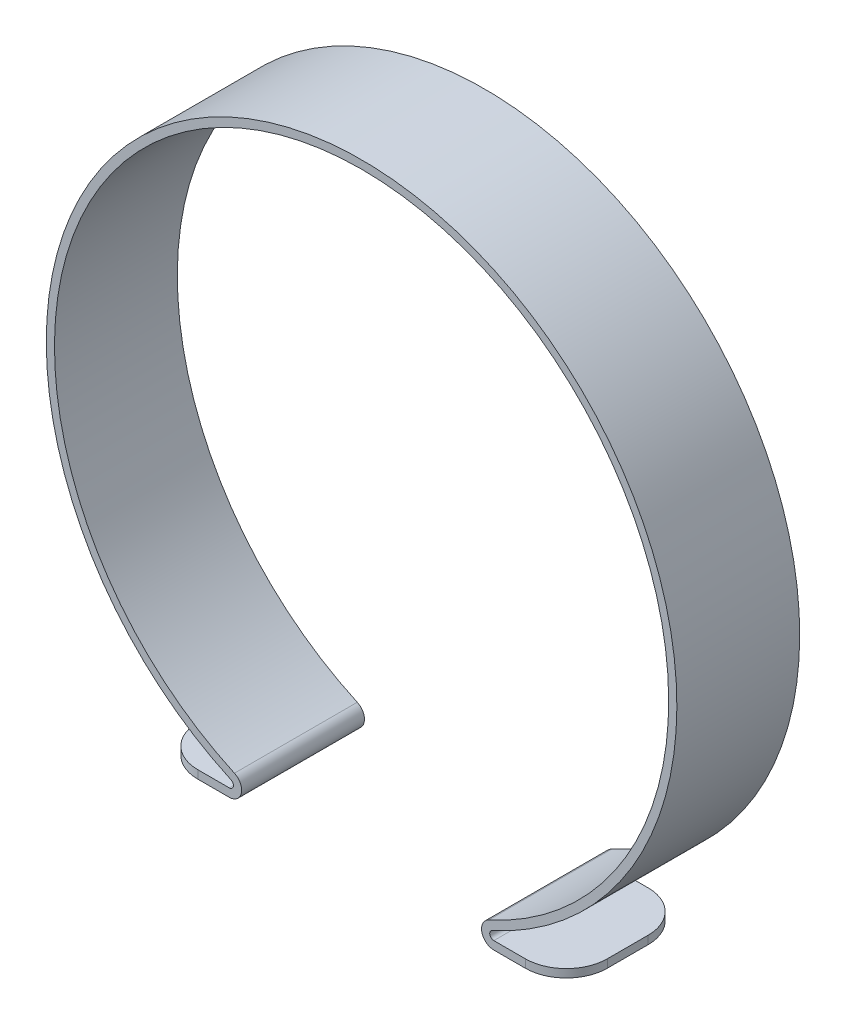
ISO-10303-21;
HEADER;
FILE_DESCRIPTION(('STEP AP214'),'2;1');
FILE_NAME('part.step','',(''),(''),'','','');
FILE_SCHEMA(('AUTOMOTIVE_DESIGN { 1 0 10303 214 1 1 1 1 }'));
ENDSEC;
DATA;
#1=APPLICATION_CONTEXT('core data for automotive mechanical design processes');
#2=APPLICATION_PROTOCOL_DEFINITION('international standard','automotive_design',2000,#1);
#3=PRODUCT_CONTEXT('',#1,'mechanical');
#4=PRODUCT('Part','Part','',(#3));
#5=PRODUCT_RELATED_PRODUCT_CATEGORY('part','',(#4));
#6=PRODUCT_DEFINITION_FORMATION('','',#4);
#7=PRODUCT_DEFINITION_CONTEXT('part definition',#1,'design');
#8=PRODUCT_DEFINITION('design','',#6,#7);
#9=PRODUCT_DEFINITION_SHAPE('','',#8);
#10=(LENGTH_UNIT() NAMED_UNIT(*) SI_UNIT(.MILLI.,.METRE.));
#11=(NAMED_UNIT(*) PLANE_ANGLE_UNIT() SI_UNIT($,.RADIAN.));
#12=(NAMED_UNIT(*) SI_UNIT($,.STERADIAN.) SOLID_ANGLE_UNIT());
#13=UNCERTAINTY_MEASURE_WITH_UNIT(LENGTH_MEASURE(1.E-05),#10,'distance_accuracy_value','');
#14=(GEOMETRIC_REPRESENTATION_CONTEXT(3) GLOBAL_UNCERTAINTY_ASSIGNED_CONTEXT((#13)) GLOBAL_UNIT_ASSIGNED_CONTEXT((#10,
#11,#12)) REPRESENTATION_CONTEXT('',''));
#15=CARTESIAN_POINT('',(0.,0.,0.));
#16=DIRECTION('',(0.,0.,1.));
#17=DIRECTION('',(1.,0.,0.));
#18=AXIS2_PLACEMENT_3D('',#15,#16,#17);
#19=CARTESIAN_POINT('',(20.,1.,10.));
#20=DIRECTION('',(0.,-1.,0.));
#21=DIRECTION('',(0.,0.,-1.));
#22=AXIS2_PLACEMENT_3D('',#19,#20,#21);
#23=CYLINDRICAL_SURFACE('',#22,5.);
#24=CARTESIAN_POINT('',(20.,0.,10.));
#25=DIRECTION('',(0.,-1.,0.));
#26=DIRECTION('',(0.,0.,-1.));
#27=AXIS2_PLACEMENT_3D('',#24,#25,#26);
#28=CIRCLE('',#27,5.);
#29=CARTESIAN_POINT('',(25.,0.,10.));
#30=VERTEX_POINT('',#29);
#31=CARTESIAN_POINT('',(20.,0.,15.));
#32=VERTEX_POINT('',#31);
#33=EDGE_CURVE('E136',#30,#32,#28,.T.);
#34=ORIENTED_EDGE('',*,*,#33,.F.);
#35=DIRECTION('',(0.,1.,0.));
#36=VECTOR('',#35,1.);
#37=CARTESIAN_POINT('',(25.,1.,10.));
#38=LINE('',#37,#36);
#39=CARTESIAN_POINT('',(25.,1.,10.));
#40=VERTEX_POINT('',#39);
#41=EDGE_CURVE('E128',#40,#30,#38,.F.);
#42=ORIENTED_EDGE('',*,*,#41,.F.);
#43=CARTESIAN_POINT('',(20.,1.,10.));
#44=DIRECTION('',(0.,-1.,0.));
#45=DIRECTION('',(0.,0.,-1.));
#46=AXIS2_PLACEMENT_3D('',#43,#44,#45);
#47=CIRCLE('',#46,5.);
#48=CARTESIAN_POINT('',(20.,1.,15.));
#49=VERTEX_POINT('',#48);
#50=EDGE_CURVE('E204',#40,#49,#47,.T.);
#51=ORIENTED_EDGE('',*,*,#50,.T.);
#52=DIRECTION('',(0.,1.,0.));
#53=VECTOR('',#52,1.);
#54=CARTESIAN_POINT('',(20.,1.5,15.));
#55=LINE('',#54,#53);
#56=EDGE_CURVE('E147',#32,#49,#55,.T.);
#57=ORIENTED_EDGE('',*,*,#56,.F.);
#58=EDGE_LOOP('',(#34,#42,#51,#57));
#59=FACE_BOUND('',#58,.T.);
#60=ADVANCED_FACE('F17',(#59),#23,.T.);
#61=CARTESIAN_POINT('',(20.,1.9551282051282,5.));
#62=DIRECTION('',(0.,-1.,0.));
#63=DIRECTION('',(0.,0.,-1.));
#64=AXIS2_PLACEMENT_3D('',#61,#62,#63);
#65=CYLINDRICAL_SURFACE('',#64,5.);
#66=CARTESIAN_POINT('',(20.,0.,5.));
#67=DIRECTION('',(0.,-1.,0.));
#68=DIRECTION('',(0.,0.,-1.));
#69=AXIS2_PLACEMENT_3D('',#66,#67,#68);
#70=CIRCLE('',#69,5.);
#71=CARTESIAN_POINT('',(20.,0.,0.));
#72=VERTEX_POINT('',#71);
#73=CARTESIAN_POINT('',(25.,0.,5.));
#74=VERTEX_POINT('',#73);
#75=EDGE_CURVE('E20',#72,#74,#70,.T.);
#76=ORIENTED_EDGE('',*,*,#75,.F.);
#77=DIRECTION('',(0.,-1.,0.));
#78=VECTOR('',#77,1.);
#79=CARTESIAN_POINT('',(20.,1.9551282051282,0.));
#80=LINE('',#79,#78);
#81=CARTESIAN_POINT('',(20.,1.,0.));
#82=VERTEX_POINT('',#81);
#83=EDGE_CURVE('E113',#72,#82,#80,.F.);
#84=ORIENTED_EDGE('',*,*,#83,.T.);
#85=CARTESIAN_POINT('',(20.,1.,5.));
#86=DIRECTION('',(0.,-1.,0.));
#87=DIRECTION('',(0.,0.,-1.));
#88=AXIS2_PLACEMENT_3D('',#85,#86,#87);
#89=CIRCLE('',#88,5.);
#90=CARTESIAN_POINT('',(25.,1.,5.));
#91=VERTEX_POINT('',#90);
#92=EDGE_CURVE('E124',#82,#91,#89,.T.);
#93=ORIENTED_EDGE('',*,*,#92,.T.);
#94=DIRECTION('',(0.,1.,0.));
#95=VECTOR('',#94,1.);
#96=CARTESIAN_POINT('',(25.,1.,5.));
#97=LINE('',#96,#95);
#98=EDGE_CURVE('E118',#74,#91,#97,.T.);
#99=ORIENTED_EDGE('',*,*,#98,.F.);
#100=EDGE_LOOP('',(#76,#84,#93,#99));
#101=FACE_BOUND('',#100,.T.);
#102=ADVANCED_FACE('F120',(#101),#65,.T.);
#103=CARTESIAN_POINT('',(25.,1.,15.));
#104=DIRECTION('',(1.,0.,0.));
#105=DIRECTION('',(0.,0.,-1.));
#106=AXIS2_PLACEMENT_3D('',#103,#104,#105);
#107=PLANE('',#106);
#108=DIRECTION('',(0.,0.,1.));
#109=VECTOR('',#108,1.);
#110=CARTESIAN_POINT('',(25.,1.,15.));
#111=LINE('',#110,#109);
#112=EDGE_CURVE('E202',#91,#40,#111,.T.);
#113=ORIENTED_EDGE('',*,*,#112,.T.);
#114=ORIENTED_EDGE('',*,*,#41,.T.);
#115=DIRECTION('',(0.,0.,1.));
#116=VECTOR('',#115,1.);
#117=CARTESIAN_POINT('',(25.,0.,15.));
#118=LINE('',#117,#116);
#119=EDGE_CURVE('E131',#74,#30,#118,.T.);
#120=ORIENTED_EDGE('',*,*,#119,.F.);
#121=ORIENTED_EDGE('',*,*,#98,.T.);
#122=EDGE_LOOP('',(#113,#114,#120,#121));
#123=FACE_BOUND('',#122,.T.);
#124=ADVANCED_FACE('F132',(#123),#107,.T.);
#125=CARTESIAN_POINT('',(25.,0.,15.));
#126=DIRECTION('',(0.,-1.,0.));
#127=DIRECTION('',(1.,0.,0.));
#128=AXIS2_PLACEMENT_3D('',#125,#126,#127);
#129=PLANE('',#128);
#130=DIRECTION('',(1.,0.,0.));
#131=VECTOR('',#130,1.);
#132=CARTESIAN_POINT('',(25.,0.,15.));
#133=LINE('',#132,#131);
#134=CARTESIAN_POINT('',(16.1477552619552,0.,15.));
#135=VERTEX_POINT('',#134);
#136=EDGE_CURVE('E206',#32,#135,#133,.F.);
#137=ORIENTED_EDGE('',*,*,#136,.T.);
#138=DIRECTION('',(0.,0.,-1.));
#139=VECTOR('',#138,1.);
#140=CARTESIAN_POINT('',(16.1477552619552,0.,15.));
#141=LINE('',#140,#139);
#142=CARTESIAN_POINT('',(16.1477552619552,0.,0.));
#143=VERTEX_POINT('',#142);
#144=EDGE_CURVE('E200',#143,#135,#141,.F.);
#145=ORIENTED_EDGE('',*,*,#144,.F.);
#146=DIRECTION('',(1.,0.,0.));
#147=VECTOR('',#146,1.);
#148=CARTESIAN_POINT('',(25.,0.,0.));
#149=LINE('',#148,#147);
#150=EDGE_CURVE('E141',#143,#72,#149,.T.);
#151=ORIENTED_EDGE('',*,*,#150,.T.);
#152=ORIENTED_EDGE('',*,*,#75,.T.);
#153=ORIENTED_EDGE('',*,*,#119,.T.);
#154=ORIENTED_EDGE('',*,*,#33,.T.);
#155=EDGE_LOOP('',(#137,#145,#151,#152,#153,#154));
#156=FACE_BOUND('',#155,.T.);
#157=ADVANCED_FACE('F139',(#156),#129,.T.);
#158=CARTESIAN_POINT('',(25.,1.,15.));
#159=DIRECTION('',(0.,-1.,0.));
#160=DIRECTION('',(1.,0.,0.));
#161=AXIS2_PLACEMENT_3D('',#158,#159,#160);
#162=PLANE('',#161);
#163=ORIENTED_EDGE('',*,*,#92,.F.);
#164=DIRECTION('',(1.,0.,0.));
#165=VECTOR('',#164,1.);
#166=CARTESIAN_POINT('',(25.,1.,0.));
#167=LINE('',#166,#165);
#168=CARTESIAN_POINT('',(16.1477552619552,1.,0.));
#169=VERTEX_POINT('',#168);
#170=EDGE_CURVE('E203',#169,#82,#167,.T.);
#171=ORIENTED_EDGE('',*,*,#170,.F.);
#172=DIRECTION('',(0.,0.,-1.));
#173=VECTOR('',#172,1.);
#174=CARTESIAN_POINT('',(16.1477552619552,1.,15.));
#175=LINE('',#174,#173);
#176=CARTESIAN_POINT('',(16.1477552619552,1.,15.));
#177=VERTEX_POINT('',#176);
#178=EDGE_CURVE('E181',#169,#177,#175,.F.);
#179=ORIENTED_EDGE('',*,*,#178,.T.);
#180=DIRECTION('',(1.,0.,0.));
#181=VECTOR('',#180,1.);
#182=CARTESIAN_POINT('',(25.,1.,15.));
#183=LINE('',#182,#181);
#184=EDGE_CURVE('E205',#49,#177,#183,.F.);
#185=ORIENTED_EDGE('',*,*,#184,.F.);
#186=ORIENTED_EDGE('',*,*,#50,.F.);
#187=ORIENTED_EDGE('',*,*,#112,.F.);
#188=EDGE_LOOP('',(#163,#171,#179,#185,#186,#187));
#189=FACE_BOUND('',#188,.T.);
#190=ADVANCED_FACE('F407',(#189),#162,.F.);
#191=CARTESIAN_POINT('',(-25.,0.,15.));
#192=DIRECTION('',(0.,-1.,0.));
#193=DIRECTION('',(1.,0.,0.));
#194=AXIS2_PLACEMENT_3D('',#191,#192,#193);
#195=PLANE('',#194);
#196=DIRECTION('',(1.,0.,0.));
#197=VECTOR('',#196,1.);
#198=CARTESIAN_POINT('',(-15.9407327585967,0.,15.));
#199=LINE('',#198,#197);
#200=CARTESIAN_POINT('',(-20.,0.,15.));
#201=VERTEX_POINT('',#200);
#202=CARTESIAN_POINT('',(-16.1477552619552,0.,15.));
#203=VERTEX_POINT('',#202);
#204=EDGE_CURVE('E194',#201,#203,#199,.T.);
#205=ORIENTED_EDGE('',*,*,#204,.F.);
#206=CARTESIAN_POINT('',(-20.,0.,10.));
#207=DIRECTION('',(0.,1.,0.));
#208=DIRECTION('',(0.,0.,1.));
#209=AXIS2_PLACEMENT_3D('',#206,#207,#208);
#210=CIRCLE('',#209,5.);
#211=CARTESIAN_POINT('',(-25.,0.,10.));
#212=VERTEX_POINT('',#211);
#213=EDGE_CURVE('E190',#212,#201,#210,.T.);
#214=ORIENTED_EDGE('',*,*,#213,.F.);
#215=DIRECTION('',(0.,0.,1.));
#216=VECTOR('',#215,1.);
#217=CARTESIAN_POINT('',(-25.,0.,15.));
#218=LINE('',#217,#216);
#219=CARTESIAN_POINT('',(-25.,0.,5.));
#220=VERTEX_POINT('',#219);
#221=EDGE_CURVE('E213',#220,#212,#218,.T.);
#222=ORIENTED_EDGE('',*,*,#221,.F.);
#223=CARTESIAN_POINT('',(-20.,0.,5.));
#224=DIRECTION('',(0.,-1.,0.));
#225=DIRECTION('',(0.,0.,-1.));
#226=AXIS2_PLACEMENT_3D('',#223,#224,#225);
#227=CIRCLE('',#226,5.);
#228=CARTESIAN_POINT('',(-20.,0.,0.));
#229=VERTEX_POINT('',#228);
#230=EDGE_CURVE('E185',#229,#220,#227,.F.);
#231=ORIENTED_EDGE('',*,*,#230,.F.);
#232=DIRECTION('',(1.,0.,0.));
#233=VECTOR('',#232,1.);
#234=CARTESIAN_POINT('',(-16.1477552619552,0.,0.));
#235=LINE('',#234,#233);
#236=CARTESIAN_POINT('',(-16.1477552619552,0.,0.));
#237=VERTEX_POINT('',#236);
#238=EDGE_CURVE('E184',#229,#237,#235,.T.);
#239=ORIENTED_EDGE('',*,*,#238,.T.);
#240=DIRECTION('',(0.,0.,-1.));
#241=VECTOR('',#240,1.);
#242=CARTESIAN_POINT('',(-16.1477552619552,0.,15.));
#243=LINE('',#242,#241);
#244=EDGE_CURVE('E172',#203,#237,#243,.T.);
#245=ORIENTED_EDGE('',*,*,#244,.F.);
#246=EDGE_LOOP('',(#205,#214,#222,#231,#239,#245));
#247=FACE_BOUND('',#246,.T.);
#248=ADVANCED_FACE('F278',(#247),#195,.T.);
#249=CARTESIAN_POINT('',(-20.,0.,10.));
#250=DIRECTION('',(0.,1.,0.));
#251=DIRECTION('',(0.,0.,1.));
#252=AXIS2_PLACEMENT_3D('',#249,#250,#251);
#253=CYLINDRICAL_SURFACE('',#252,5.);
#254=CARTESIAN_POINT('',(-20.,1.,10.));
#255=DIRECTION('',(0.,1.,0.));
#256=DIRECTION('',(0.,0.,1.));
#257=AXIS2_PLACEMENT_3D('',#254,#255,#256);
#258=CIRCLE('',#257,5.);
#259=CARTESIAN_POINT('',(-20.,1.,15.));
#260=VERTEX_POINT('',#259);
#261=CARTESIAN_POINT('',(-25.,1.,10.));
#262=VERTEX_POINT('',#261);
#263=EDGE_CURVE('E165',#260,#262,#258,.F.);
#264=ORIENTED_EDGE('',*,*,#263,.T.);
#265=DIRECTION('',(0.,1.,0.));
#266=VECTOR('',#265,1.);
#267=CARTESIAN_POINT('',(-25.,0.,10.));
#268=LINE('',#267,#266);
#269=EDGE_CURVE('E189',#212,#262,#268,.T.);
#270=ORIENTED_EDGE('',*,*,#269,.F.);
#271=ORIENTED_EDGE('',*,*,#213,.T.);
#272=DIRECTION('',(0.,1.,0.));
#273=VECTOR('',#272,1.);
#274=CARTESIAN_POINT('',(-20.,0.,15.));
#275=LINE('',#274,#273);
#276=EDGE_CURVE('E193',#201,#260,#275,.T.);
#277=ORIENTED_EDGE('',*,*,#276,.T.);
#278=EDGE_LOOP('',(#264,#270,#271,#277));
#279=FACE_BOUND('',#278,.T.);
#280=ADVANCED_FACE('F275',(#279),#253,.T.);
#281=CARTESIAN_POINT('',(-25.,0.,15.));
#282=DIRECTION('',(-1.,0.,0.));
#283=DIRECTION('',(0.,0.,1.));
#284=AXIS2_PLACEMENT_3D('',#281,#282,#283);
#285=PLANE('',#284);
#286=ORIENTED_EDGE('',*,*,#221,.T.);
#287=ORIENTED_EDGE('',*,*,#269,.T.);
#288=DIRECTION('',(0.,0.,1.));
#289=VECTOR('',#288,1.);
#290=CARTESIAN_POINT('',(-25.,1.,15.));
#291=LINE('',#290,#289);
#292=CARTESIAN_POINT('',(-25.,1.,5.));
#293=VERTEX_POINT('',#292);
#294=EDGE_CURVE('E164',#262,#293,#291,.F.);
#295=ORIENTED_EDGE('',*,*,#294,.T.);
#296=DIRECTION('',(0.,-1.,0.));
#297=VECTOR('',#296,1.);
#298=CARTESIAN_POINT('',(-25.,1.5,5.));
#299=LINE('',#298,#297);
#300=EDGE_CURVE('E188',#220,#293,#299,.F.);
#301=ORIENTED_EDGE('',*,*,#300,.F.);
#302=EDGE_LOOP('',(#286,#287,#295,#301));
#303=FACE_BOUND('',#302,.T.);
#304=ADVANCED_FACE('F288',(#303),#285,.T.);
#305=CARTESIAN_POINT('',(-20.,1.5,5.));
#306=DIRECTION('',(0.,-1.,0.));
#307=DIRECTION('',(0.,0.,-1.));
#308=AXIS2_PLACEMENT_3D('',#305,#306,#307);
#309=CYLINDRICAL_SURFACE('',#308,5.);
#310=CARTESIAN_POINT('',(-20.,1.,5.));
#311=DIRECTION('',(0.,-1.,0.));
#312=DIRECTION('',(0.,0.,-1.));
#313=AXIS2_PLACEMENT_3D('',#310,#311,#312);
#314=CIRCLE('',#313,5.);
#315=CARTESIAN_POINT('',(-20.,1.,0.));
#316=VERTEX_POINT('',#315);
#317=EDGE_CURVE('E160',#293,#316,#314,.T.);
#318=ORIENTED_EDGE('',*,*,#317,.T.);
#319=DIRECTION('',(0.,1.,0.));
#320=VECTOR('',#319,1.);
#321=CARTESIAN_POINT('',(-20.,1.5,0.));
#322=LINE('',#321,#320);
#323=EDGE_CURVE('E218',#316,#229,#322,.F.);
#324=ORIENTED_EDGE('',*,*,#323,.T.);
#325=ORIENTED_EDGE('',*,*,#230,.T.);
#326=ORIENTED_EDGE('',*,*,#300,.T.);
#327=EDGE_LOOP('',(#318,#324,#325,#326));
#328=FACE_BOUND('',#327,.T.);
#329=ADVANCED_FACE('F290',(#328),#309,.T.);
#330=CARTESIAN_POINT('',(16.1477552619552,1.5,15.));
#331=DIRECTION('',(0.,0.,-1.));
#332=DIRECTION('',(-1.,0.,0.));
#333=AXIS2_PLACEMENT_3D('',#330,#331,#332);
#334=CYLINDRICAL_SURFACE('',#333,1.5);
#335=DIRECTION('',(0.,0.,-1.));
#336=VECTOR('',#335,1.);
#337=CARTESIAN_POINT('',(15.5266877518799,2.86538461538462,15.));
#338=LINE('',#337,#336);
#339=CARTESIAN_POINT('',(15.52668775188,2.86538461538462,15.));
#340=VERTEX_POINT('',#339);
#341=CARTESIAN_POINT('',(15.52668775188,2.86538461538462,0.));
#342=VERTEX_POINT('',#341);
#343=EDGE_CURVE('E242',#340,#342,#338,.T.);
#344=ORIENTED_EDGE('',*,*,#343,.T.);
#345=CARTESIAN_POINT('',(16.1477552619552,1.5,0.));
#346=DIRECTION('',(0.,0.,-1.));
#347=DIRECTION('',(-1.,0.,0.));
#348=AXIS2_PLACEMENT_3D('',#345,#346,#347);
#349=CIRCLE('',#348,1.5);
#350=EDGE_CURVE('E174',#342,#143,#349,.F.);
#351=ORIENTED_EDGE('',*,*,#350,.T.);
#352=ORIENTED_EDGE('',*,*,#144,.T.);
#353=CARTESIAN_POINT('',(16.1477552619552,1.5,15.));
#354=DIRECTION('',(0.,0.,-1.));
#355=DIRECTION('',(-1.,0.,0.));
#356=AXIS2_PLACEMENT_3D('',#353,#354,#355);
#357=CIRCLE('',#356,1.5);
#358=EDGE_CURVE('E176',#135,#340,#357,.T.);
#359=ORIENTED_EDGE('',*,*,#358,.T.);
#360=EDGE_LOOP('',(#344,#351,#352,#359));
#361=FACE_BOUND('',#360,.T.);
#362=ADVANCED_FACE('F297',(#361),#334,.T.);
#363=CARTESIAN_POINT('',(-16.1477552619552,1.5,15.));
#364=DIRECTION('',(0.,0.,-1.));
#365=DIRECTION('',(-1.,0.,0.));
#366=AXIS2_PLACEMENT_3D('',#363,#364,#365);
#367=CYLINDRICAL_SURFACE('',#366,1.5);
#368=CARTESIAN_POINT('',(-16.1477552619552,1.5,15.));
#369=DIRECTION('',(0.,0.,-1.));
#370=DIRECTION('',(-1.,0.,0.));
#371=AXIS2_PLACEMENT_3D('',#368,#369,#370);
#372=CIRCLE('',#371,1.5);
#373=CARTESIAN_POINT('',(-15.5266877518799,2.86538461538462,15.));
#374=VERTEX_POINT('',#373);
#375=EDGE_CURVE('E169',#374,#203,#372,.T.);
#376=ORIENTED_EDGE('',*,*,#375,.T.);
#377=ORIENTED_EDGE('',*,*,#244,.T.);
#378=CARTESIAN_POINT('',(-16.1477552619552,1.5,0.));
#379=DIRECTION('',(0.,0.,-1.));
#380=DIRECTION('',(-1.,0.,0.));
#381=AXIS2_PLACEMENT_3D('',#378,#379,#380);
#382=CIRCLE('',#381,1.5);
#383=CARTESIAN_POINT('',(-15.5266877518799,2.86538461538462,0.));
#384=VERTEX_POINT('',#383);
#385=EDGE_CURVE('E35',#237,#384,#382,.F.);
#386=ORIENTED_EDGE('',*,*,#385,.T.);
#387=DIRECTION('',(0.,0.,-1.));
#388=VECTOR('',#387,1.);
#389=CARTESIAN_POINT('',(-15.5266877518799,2.86538461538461,15.));
#390=LINE('',#389,#388);
#391=EDGE_CURVE('E233',#384,#374,#390,.F.);
#392=ORIENTED_EDGE('',*,*,#391,.T.);
#393=EDGE_LOOP('',(#376,#377,#386,#392));
#394=FACE_BOUND('',#393,.T.);
#395=ADVANCED_FACE('F291',(#394),#367,.T.);
#396=CARTESIAN_POINT('',(-25.,1.,15.));
#397=DIRECTION('',(0.,-1.,0.));
#398=DIRECTION('',(1.,0.,0.));
#399=AXIS2_PLACEMENT_3D('',#396,#397,#398);
#400=PLANE('',#399);
#401=ORIENTED_EDGE('',*,*,#317,.F.);
#402=ORIENTED_EDGE('',*,*,#294,.F.);
#403=ORIENTED_EDGE('',*,*,#263,.F.);
#404=DIRECTION('',(1.,0.,0.));
#405=VECTOR('',#404,1.);
#406=CARTESIAN_POINT('',(-25.,1.,15.));
#407=LINE('',#406,#405);
#408=CARTESIAN_POINT('',(-16.1477552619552,1.,15.));
#409=VERTEX_POINT('',#408);
#410=EDGE_CURVE('E168',#409,#260,#407,.F.);
#411=ORIENTED_EDGE('',*,*,#410,.F.);
#412=DIRECTION('',(0.,0.,-1.));
#413=VECTOR('',#412,1.);
#414=CARTESIAN_POINT('',(-16.1477552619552,1.,15.));
#415=LINE('',#414,#413);
#416=CARTESIAN_POINT('',(-16.1477552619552,1.,0.));
#417=VERTEX_POINT('',#416);
#418=EDGE_CURVE('E159',#409,#417,#415,.T.);
#419=ORIENTED_EDGE('',*,*,#418,.T.);
#420=DIRECTION('',(1.,0.,0.));
#421=VECTOR('',#420,1.);
#422=CARTESIAN_POINT('',(-25.,1.,0.));
#423=LINE('',#422,#421);
#424=EDGE_CURVE('E163',#316,#417,#423,.T.);
#425=ORIENTED_EDGE('',*,*,#424,.F.);
#426=EDGE_LOOP('',(#401,#402,#403,#411,#419,#425));
#427=FACE_BOUND('',#426,.T.);
#428=ADVANCED_FACE('F265',(#427),#400,.F.);
#429=CARTESIAN_POINT('',(16.1477552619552,1.5,15.));
#430=DIRECTION('',(0.,0.,-1.));
#431=DIRECTION('',(-1.,0.,0.));
#432=AXIS2_PLACEMENT_3D('',#429,#430,#431);
#433=CYLINDRICAL_SURFACE('',#432,0.5);
#434=DIRECTION('',(0.,0.,-1.));
#435=VECTOR('',#434,1.);
#436=CARTESIAN_POINT('',(15.9407327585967,1.95512820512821,15.));
#437=LINE('',#436,#435);
#438=CARTESIAN_POINT('',(15.9407327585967,1.9551282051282,15.));
#439=VERTEX_POINT('',#438);
#440=CARTESIAN_POINT('',(15.9407327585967,1.9551282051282,0.));
#441=VERTEX_POINT('',#440);
#442=EDGE_CURVE('E156',#439,#441,#437,.T.);
#443=ORIENTED_EDGE('',*,*,#442,.F.);
#444=CARTESIAN_POINT('',(16.1477552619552,1.5,15.));
#445=DIRECTION('',(0.,0.,-1.));
#446=DIRECTION('',(-1.,0.,0.));
#447=AXIS2_PLACEMENT_3D('',#444,#445,#446);
#448=CIRCLE('',#447,0.5);
#449=EDGE_CURVE('E179',#177,#439,#448,.T.);
#450=ORIENTED_EDGE('',*,*,#449,.F.);
#451=ORIENTED_EDGE('',*,*,#178,.F.);
#452=CARTESIAN_POINT('',(16.1477552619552,1.5,0.));
#453=DIRECTION('',(0.,0.,-1.));
#454=DIRECTION('',(-1.,0.,0.));
#455=AXIS2_PLACEMENT_3D('',#452,#453,#454);
#456=CIRCLE('',#455,0.5);
#457=EDGE_CURVE('E182',#441,#169,#456,.F.);
#458=ORIENTED_EDGE('',*,*,#457,.F.);
#459=EDGE_LOOP('',(#443,#450,#451,#458));
#460=FACE_BOUND('',#459,.T.);
#461=ADVANCED_FACE('F320',(#460),#433,.F.);
#462=CARTESIAN_POINT('',(0.,37.,15.));
#463=DIRECTION('',(0.,0.,-1.));
#464=DIRECTION('',(-1.,0.,0.));
#465=AXIS2_PLACEMENT_3D('',#462,#463,#464);
#466=CYLINDRICAL_SURFACE('',#465,37.5);
#467=CARTESIAN_POINT('',(0.,37.,15.));
#468=DIRECTION('',(0.,0.,-1.));
#469=DIRECTION('',(-1.,0.,0.));
#470=AXIS2_PLACEMENT_3D('',#467,#468,#469);
#471=CIRCLE('',#470,37.5);
#472=EDGE_CURVE('E157',#374,#340,#471,.T.);
#473=ORIENTED_EDGE('',*,*,#472,.F.);
#474=ORIENTED_EDGE('',*,*,#391,.F.);
#475=CARTESIAN_POINT('',(0.,37.,0.));
#476=DIRECTION('',(0.,0.,-1.));
#477=DIRECTION('',(-1.,0.,0.));
#478=AXIS2_PLACEMENT_3D('',#475,#476,#477);
#479=CIRCLE('',#478,37.5);
#480=EDGE_CURVE('E153',#342,#384,#479,.F.);
#481=ORIENTED_EDGE('',*,*,#480,.F.);
#482=ORIENTED_EDGE('',*,*,#343,.F.);
#483=EDGE_LOOP('',(#473,#474,#481,#482));
#484=FACE_BOUND('',#483,.T.);
#485=ADVANCED_FACE('F295',(#484),#466,.F.);
#486=CARTESIAN_POINT('',(-16.1477552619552,1.5,15.));
#487=DIRECTION('',(0.,0.,-1.));
#488=DIRECTION('',(-1.,0.,0.));
#489=AXIS2_PLACEMENT_3D('',#486,#487,#488);
#490=CYLINDRICAL_SURFACE('',#489,0.5);
#491=ORIENTED_EDGE('',*,*,#418,.F.);
#492=CARTESIAN_POINT('',(-16.1477552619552,1.5,15.));
#493=DIRECTION('',(0.,0.,-1.));
#494=DIRECTION('',(-1.,0.,0.));
#495=AXIS2_PLACEMENT_3D('',#492,#493,#494);
#496=CIRCLE('',#495,0.5);
#497=CARTESIAN_POINT('',(-15.9407327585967,1.95512820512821,15.));
#498=VERTEX_POINT('',#497);
#499=EDGE_CURVE('E195',#498,#409,#496,.T.);
#500=ORIENTED_EDGE('',*,*,#499,.F.);
#501=DIRECTION('',(0.,0.,-1.));
#502=VECTOR('',#501,1.);
#503=CARTESIAN_POINT('',(-15.9407327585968,1.95512820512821,15.));
#504=LINE('',#503,#502);
#505=CARTESIAN_POINT('',(-15.9407327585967,1.95512820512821,0.));
#506=VERTEX_POINT('',#505);
#507=EDGE_CURVE('E152',#506,#498,#504,.F.);
#508=ORIENTED_EDGE('',*,*,#507,.F.);
#509=CARTESIAN_POINT('',(-16.1477552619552,1.5,0.));
#510=DIRECTION('',(0.,0.,-1.));
#511=DIRECTION('',(-1.,0.,0.));
#512=AXIS2_PLACEMENT_3D('',#509,#510,#511);
#513=CIRCLE('',#512,0.5);
#514=EDGE_CURVE('E197',#417,#506,#513,.F.);
#515=ORIENTED_EDGE('',*,*,#514,.F.);
#516=EDGE_LOOP('',(#491,#500,#508,#515));
#517=FACE_BOUND('',#516,.T.);
#518=ADVANCED_FACE('F257',(#517),#490,.F.);
#519=CARTESIAN_POINT('',(16.1477552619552,1.,15.));
#520=DIRECTION('',(0.,0.,1.));
#521=DIRECTION('',(1.,0.,0.));
#522=AXIS2_PLACEMENT_3D('',#519,#520,#521);
#523=PLANE('',#522);
#524=ORIENTED_EDGE('',*,*,#375,.F.);
#525=ORIENTED_EDGE('',*,*,#472,.T.);
#526=ORIENTED_EDGE('',*,*,#358,.F.);
#527=ORIENTED_EDGE('',*,*,#136,.F.);
#528=ORIENTED_EDGE('',*,*,#56,.T.);
#529=ORIENTED_EDGE('',*,*,#184,.T.);
#530=ORIENTED_EDGE('',*,*,#449,.T.);
#531=CARTESIAN_POINT('',(0.,37.,15.));
#532=DIRECTION('',(0.,0.,-1.));
#533=DIRECTION('',(-1.,0.,0.));
#534=AXIS2_PLACEMENT_3D('',#531,#532,#533);
#535=CIRCLE('',#534,38.5);
#536=EDGE_CURVE('E26',#498,#439,#535,.T.);
#537=ORIENTED_EDGE('',*,*,#536,.F.);
#538=ORIENTED_EDGE('',*,*,#499,.T.);
#539=ORIENTED_EDGE('',*,*,#410,.T.);
#540=ORIENTED_EDGE('',*,*,#276,.F.);
#541=ORIENTED_EDGE('',*,*,#204,.T.);
#542=EDGE_LOOP('',(#524,#525,#526,#527,#528,#529,#530,#537,#538,#539,#540,#541));
#543=FACE_BOUND('',#542,.T.);
#544=ADVANCED_FACE('F271',(#543),#523,.T.);
#545=CARTESIAN_POINT('',(-16.1477552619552,1.,0.));
#546=DIRECTION('',(0.,0.,-1.));
#547=DIRECTION('',(-1.,0.,0.));
#548=AXIS2_PLACEMENT_3D('',#545,#546,#547);
#549=PLANE('',#548);
#550=CARTESIAN_POINT('',(0.,37.,0.));
#551=DIRECTION('',(0.,0.,-1.));
#552=DIRECTION('',(-1.,0.,0.));
#553=AXIS2_PLACEMENT_3D('',#550,#551,#552);
#554=CIRCLE('',#553,38.5);
#555=EDGE_CURVE('E11',#441,#506,#554,.F.);
#556=ORIENTED_EDGE('',*,*,#555,.F.);
#557=ORIENTED_EDGE('',*,*,#457,.T.);
#558=ORIENTED_EDGE('',*,*,#170,.T.);
#559=ORIENTED_EDGE('',*,*,#83,.F.);
#560=ORIENTED_EDGE('',*,*,#150,.F.);
#561=ORIENTED_EDGE('',*,*,#350,.F.);
#562=ORIENTED_EDGE('',*,*,#480,.T.);
#563=ORIENTED_EDGE('',*,*,#385,.F.);
#564=ORIENTED_EDGE('',*,*,#238,.F.);
#565=ORIENTED_EDGE('',*,*,#323,.F.);
#566=ORIENTED_EDGE('',*,*,#424,.T.);
#567=ORIENTED_EDGE('',*,*,#514,.T.);
#568=EDGE_LOOP('',(#556,#557,#558,#559,#560,#561,#562,#563,#564,#565,#566,#567));
#569=FACE_BOUND('',#568,.T.);
#570=ADVANCED_FACE('F258',(#569),#549,.T.);
#571=CARTESIAN_POINT('',(0.,37.,15.));
#572=DIRECTION('',(0.,0.,-1.));
#573=DIRECTION('',(-1.,0.,0.));
#574=AXIS2_PLACEMENT_3D('',#571,#572,#573);
#575=CYLINDRICAL_SURFACE('',#574,38.5);
#576=ORIENTED_EDGE('',*,*,#555,.T.);
#577=ORIENTED_EDGE('',*,*,#507,.T.);
#578=ORIENTED_EDGE('',*,*,#536,.T.);
#579=ORIENTED_EDGE('',*,*,#442,.T.);
#580=EDGE_LOOP('',(#576,#577,#578,#579));
#581=FACE_BOUND('',#580,.T.);
#582=ADVANCED_FACE('F251',(#581),#575,.T.);
#583=CLOSED_SHELL('',(#60,#102,#124,#157,#190,#248,#280,#304,#329,#362,#395,#428,#461,#485,#518,
#544,#570,#582));
#584=MANIFOLD_SOLID_BREP('B1',#583);
#585=ADVANCED_BREP_SHAPE_REPRESENTATION('',(#18,#584),#14);
#586=SHAPE_DEFINITION_REPRESENTATION(#9,#585);
ENDSEC;
END-ISO-10303-21;
